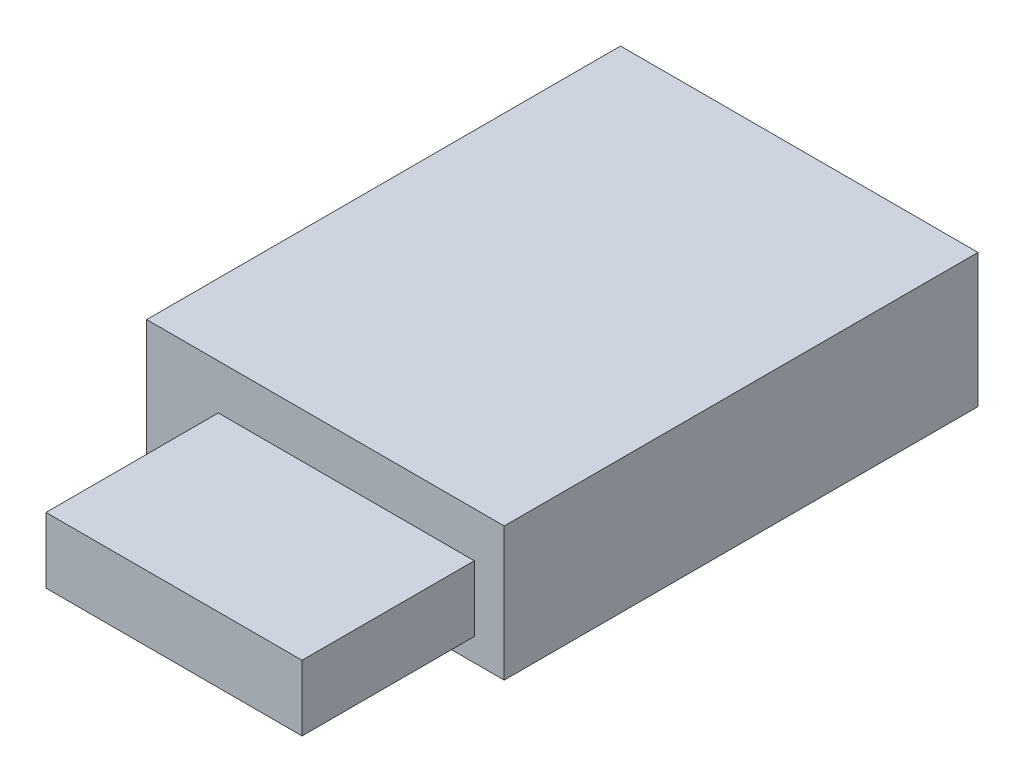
ISO-10303-21;
HEADER;
FILE_DESCRIPTION(('STEP AP214'),'2;1');
FILE_NAME('part.step','',(''),(''),'','','');
FILE_SCHEMA(('AUTOMOTIVE_DESIGN { 1 0 10303 214 1 1 1 1 }'));
ENDSEC;
DATA;
#1=APPLICATION_CONTEXT('core data for automotive mechanical design processes');
#2=APPLICATION_PROTOCOL_DEFINITION('international standard','automotive_design',2000,#1);
#3=PRODUCT_CONTEXT('',#1,'mechanical');
#4=PRODUCT('Part','Part','',(#3));
#5=PRODUCT_RELATED_PRODUCT_CATEGORY('part','',(#4));
#6=PRODUCT_DEFINITION_FORMATION('','',#4);
#7=PRODUCT_DEFINITION_CONTEXT('part definition',#1,'design');
#8=PRODUCT_DEFINITION('design','',#6,#7);
#9=PRODUCT_DEFINITION_SHAPE('','',#8);
#10=(LENGTH_UNIT() NAMED_UNIT(*) SI_UNIT(.MILLI.,.METRE.));
#11=(NAMED_UNIT(*) PLANE_ANGLE_UNIT() SI_UNIT($,.RADIAN.));
#12=(NAMED_UNIT(*) SI_UNIT($,.STERADIAN.) SOLID_ANGLE_UNIT());
#13=UNCERTAINTY_MEASURE_WITH_UNIT(LENGTH_MEASURE(1.E-05),#10,'distance_accuracy_value','');
#14=(GEOMETRIC_REPRESENTATION_CONTEXT(3) GLOBAL_UNCERTAINTY_ASSIGNED_CONTEXT((#13)) GLOBAL_UNIT_ASSIGNED_CONTEXT((#10,
#11,#12)) REPRESENTATION_CONTEXT('',''));
#15=CARTESIAN_POINT('',(0.,0.,0.));
#16=DIRECTION('',(0.,0.,1.));
#17=DIRECTION('',(1.,0.,0.));
#18=AXIS2_PLACEMENT_3D('',#15,#16,#17);
#19=CARTESIAN_POINT('',(-39.4278240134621,39.37,48.3702170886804));
#20=DIRECTION('',(0.,0.,-1.));
#21=DIRECTION('',(-1.,0.,0.));
#22=AXIS2_PLACEMENT_3D('',#19,#20,#21);
#23=PLANE('',#22);
#24=DIRECTION('',(1.,0.,0.));
#25=VECTOR('',#24,1.);
#26=CARTESIAN_POINT('',(-39.4278240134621,0.,48.3702170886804));
#27=LINE('',#26,#25);
#28=CARTESIAN_POINT('',(-39.4278240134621,0.,48.3702170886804));
#29=VERTEX_POINT('',#28);
#30=CARTESIAN_POINT('',(65.9821759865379,0.,48.3702170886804));
#31=VERTEX_POINT('',#30);
#32=EDGE_CURVE('E122',#29,#31,#27,.T.);
#33=ORIENTED_EDGE('',*,*,#32,.T.);
#34=DIRECTION('',(0.,-1.,0.));
#35=VECTOR('',#34,1.);
#36=CARTESIAN_POINT('',(65.9821759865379,39.37,48.3702170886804));
#37=LINE('',#36,#35);
#38=CARTESIAN_POINT('',(65.9821759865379,39.37,48.3702170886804));
#39=VERTEX_POINT('',#38);
#40=EDGE_CURVE('E41',#39,#31,#37,.T.);
#41=ORIENTED_EDGE('',*,*,#40,.F.);
#42=DIRECTION('',(1.,0.,0.));
#43=VECTOR('',#42,1.);
#44=CARTESIAN_POINT('',(-39.4278240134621,39.37,48.3702170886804));
#45=LINE('',#44,#43);
#46=CARTESIAN_POINT('',(-39.4278240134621,39.37,48.3702170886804));
#47=VERTEX_POINT('',#46);
#48=EDGE_CURVE('E131',#47,#39,#45,.T.);
#49=ORIENTED_EDGE('',*,*,#48,.F.);
#50=DIRECTION('',(0.,-1.,0.));
#51=VECTOR('',#50,1.);
#52=CARTESIAN_POINT('',(-39.4278240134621,39.37,48.3702170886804));
#53=LINE('',#52,#51);
#54=EDGE_CURVE('E11',#47,#29,#53,.T.);
#55=ORIENTED_EDGE('',*,*,#54,.T.);
#56=EDGE_LOOP('',(#33,#41,#49,#55));
#57=FACE_BOUND('',#56,.T.);
#58=DIRECTION('',(0.,-1.,0.));
#59=VECTOR('',#58,1.);
#60=CARTESIAN_POINT('',(-18.3243200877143,26.0740760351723,48.3702170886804));
#61=LINE('',#60,#59);
#62=CARTESIAN_POINT('',(-18.3243200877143,26.0740760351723,48.3702170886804));
#63=VERTEX_POINT('',#62);
#64=CARTESIAN_POINT('',(-18.3243200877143,6.737061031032,48.3702170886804));
#65=VERTEX_POINT('',#64);
#66=EDGE_CURVE('E118',#63,#65,#61,.T.);
#67=ORIENTED_EDGE('',*,*,#66,.F.);
#68=DIRECTION('',(-1.,0.,0.));
#69=VECTOR('',#68,1.);
#70=CARTESIAN_POINT('',(-18.3243200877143,26.0740760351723,48.3702170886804));
#71=LINE('',#70,#69);
#72=CARTESIAN_POINT('',(57.1671559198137,26.0740760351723,48.3702170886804));
#73=VERTEX_POINT('',#72);
#74=EDGE_CURVE('E115',#73,#63,#71,.T.);
#75=ORIENTED_EDGE('',*,*,#74,.F.);
#76=DIRECTION('',(0.,1.,0.));
#77=VECTOR('',#76,1.);
#78=CARTESIAN_POINT('',(57.1671559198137,26.0740760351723,48.3702170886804));
#79=LINE('',#78,#77);
#80=CARTESIAN_POINT('',(57.1671559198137,6.737061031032,48.3702170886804));
#81=VERTEX_POINT('',#80);
#82=EDGE_CURVE('E53',#81,#73,#79,.T.);
#83=ORIENTED_EDGE('',*,*,#82,.F.);
#84=DIRECTION('',(1.,0.,0.));
#85=VECTOR('',#84,1.);
#86=CARTESIAN_POINT('',(-18.3243200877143,6.737061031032,48.3702170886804));
#87=LINE('',#86,#85);
#88=EDGE_CURVE('E48',#65,#81,#87,.T.);
#89=ORIENTED_EDGE('',*,*,#88,.F.);
#90=EDGE_LOOP('',(#67,#75,#83,#89));
#91=FACE_BOUND('',#90,.T.);
#92=ADVANCED_FACE('F33',(#57,#91),#23,.F.);
#93=CARTESIAN_POINT('',(-39.4278240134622,39.37,-91.3297829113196));
#94=DIRECTION('',(1.,0.,0.));
#95=DIRECTION('',(0.,0.,-1.));
#96=AXIS2_PLACEMENT_3D('',#93,#94,#95);
#97=PLANE('',#96);
#98=DIRECTION('',(0.,0.,1.));
#99=VECTOR('',#98,1.);
#100=CARTESIAN_POINT('',(-39.4278240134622,0.,-91.3297829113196));
#101=LINE('',#100,#99);
#102=CARTESIAN_POINT('',(-39.4278240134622,0.,-91.3297829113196));
#103=VERTEX_POINT('',#102);
#104=EDGE_CURVE('E119',#103,#29,#101,.T.);
#105=ORIENTED_EDGE('',*,*,#104,.T.);
#106=ORIENTED_EDGE('',*,*,#54,.F.);
#107=DIRECTION('',(0.,0.,1.));
#108=VECTOR('',#107,1.);
#109=CARTESIAN_POINT('',(-39.4278240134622,39.37,-91.3297829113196));
#110=LINE('',#109,#108);
#111=CARTESIAN_POINT('',(-39.4278240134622,39.37,-91.3297829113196));
#112=VERTEX_POINT('',#111);
#113=EDGE_CURVE('E128',#112,#47,#110,.T.);
#114=ORIENTED_EDGE('',*,*,#113,.F.);
#115=DIRECTION('',(0.,-1.,0.));
#116=VECTOR('',#115,1.);
#117=CARTESIAN_POINT('',(-39.4278240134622,39.37,-91.3297829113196));
#118=LINE('',#117,#116);
#119=EDGE_CURVE('E137',#112,#103,#118,.T.);
#120=ORIENTED_EDGE('',*,*,#119,.T.);
#121=EDGE_LOOP('',(#105,#106,#114,#120));
#122=FACE_BOUND('',#121,.T.);
#123=ADVANCED_FACE('F35',(#122),#97,.F.);
#124=CARTESIAN_POINT('',(65.9821759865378,39.37,-91.3297829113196));
#125=DIRECTION('',(-1.,0.,0.));
#126=DIRECTION('',(0.,0.,1.));
#127=AXIS2_PLACEMENT_3D('',#124,#125,#126);
#128=PLANE('',#127);
#129=DIRECTION('',(0.,0.,-1.));
#130=VECTOR('',#129,1.);
#131=CARTESIAN_POINT('',(65.9821759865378,0.,-91.3297829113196));
#132=LINE('',#131,#130);
#133=CARTESIAN_POINT('',(65.9821759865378,0.,-91.3297829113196));
#134=VERTEX_POINT('',#133);
#135=EDGE_CURVE('E140',#31,#134,#132,.T.);
#136=ORIENTED_EDGE('',*,*,#135,.T.);
#137=DIRECTION('',(0.,-1.,0.));
#138=VECTOR('',#137,1.);
#139=CARTESIAN_POINT('',(65.9821759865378,39.37,-91.3297829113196));
#140=LINE('',#139,#138);
#141=CARTESIAN_POINT('',(65.9821759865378,39.37,-91.3297829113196));
#142=VERTEX_POINT('',#141);
#143=EDGE_CURVE('E145',#142,#134,#140,.T.);
#144=ORIENTED_EDGE('',*,*,#143,.F.);
#145=DIRECTION('',(0.,0.,-1.));
#146=VECTOR('',#145,1.);
#147=CARTESIAN_POINT('',(65.9821759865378,39.37,-91.3297829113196));
#148=LINE('',#147,#146);
#149=EDGE_CURVE('E134',#39,#142,#148,.T.);
#150=ORIENTED_EDGE('',*,*,#149,.F.);
#151=ORIENTED_EDGE('',*,*,#40,.T.);
#152=EDGE_LOOP('',(#136,#144,#150,#151));
#153=FACE_BOUND('',#152,.T.);
#154=ADVANCED_FACE('F152',(#153),#128,.F.);
#155=CARTESIAN_POINT('',(-39.4278240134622,39.37,-91.3297829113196));
#156=DIRECTION('',(0.,0.,1.));
#157=DIRECTION('',(1.,0.,0.));
#158=AXIS2_PLACEMENT_3D('',#155,#156,#157);
#159=PLANE('',#158);
#160=DIRECTION('',(-1.,0.,0.));
#161=VECTOR('',#160,1.);
#162=CARTESIAN_POINT('',(-39.4278240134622,0.,-91.3297829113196));
#163=LINE('',#162,#161);
#164=EDGE_CURVE('E132',#134,#103,#163,.T.);
#165=ORIENTED_EDGE('',*,*,#164,.T.);
#166=ORIENTED_EDGE('',*,*,#119,.F.);
#167=DIRECTION('',(-1.,0.,0.));
#168=VECTOR('',#167,1.);
#169=CARTESIAN_POINT('',(-39.4278240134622,39.37,-91.3297829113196));
#170=LINE('',#169,#168);
#171=EDGE_CURVE('E136',#142,#112,#170,.T.);
#172=ORIENTED_EDGE('',*,*,#171,.F.);
#173=ORIENTED_EDGE('',*,*,#143,.T.);
#174=EDGE_LOOP('',(#165,#166,#172,#173));
#175=FACE_BOUND('',#174,.T.);
#176=ADVANCED_FACE('F161',(#175),#159,.F.);
#177=CARTESIAN_POINT('',(-39.4278240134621,39.37,48.3702170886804));
#178=DIRECTION('',(0.,1.,0.));
#179=DIRECTION('',(0.,0.,1.));
#180=AXIS2_PLACEMENT_3D('',#177,#178,#179);
#181=PLANE('',#180);
#182=ORIENTED_EDGE('',*,*,#113,.T.);
#183=ORIENTED_EDGE('',*,*,#48,.T.);
#184=ORIENTED_EDGE('',*,*,#149,.T.);
#185=ORIENTED_EDGE('',*,*,#171,.T.);
#186=EDGE_LOOP('',(#182,#183,#184,#185));
#187=FACE_BOUND('',#186,.T.);
#188=ADVANCED_FACE('F167',(#187),#181,.T.);
#189=CARTESIAN_POINT('',(-39.4278240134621,0.,48.3702170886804));
#190=DIRECTION('',(0.,1.,0.));
#191=DIRECTION('',(0.,0.,1.));
#192=AXIS2_PLACEMENT_3D('',#189,#190,#191);
#193=PLANE('',#192);
#194=ORIENTED_EDGE('',*,*,#104,.F.);
#195=ORIENTED_EDGE('',*,*,#164,.F.);
#196=ORIENTED_EDGE('',*,*,#135,.F.);
#197=ORIENTED_EDGE('',*,*,#32,.F.);
#198=EDGE_LOOP('',(#194,#195,#196,#197));
#199=FACE_BOUND('',#198,.T.);
#200=ADVANCED_FACE('F158',(#199),#193,.F.);
#201=CARTESIAN_POINT('',(-18.3243200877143,26.0740760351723,99.1702170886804));
#202=DIRECTION('',(1.,0.,0.));
#203=DIRECTION('',(0.,0.,-1.));
#204=AXIS2_PLACEMENT_3D('',#201,#202,#203);
#205=PLANE('',#204);
#206=ORIENTED_EDGE('',*,*,#66,.T.);
#207=DIRECTION('',(0.,0.,-1.));
#208=VECTOR('',#207,1.);
#209=CARTESIAN_POINT('',(-18.3243200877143,6.737061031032,99.1702170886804));
#210=LINE('',#209,#208);
#211=CARTESIAN_POINT('',(-18.3243200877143,6.737061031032,99.1702170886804));
#212=VERTEX_POINT('',#211);
#213=EDGE_CURVE('E99',#212,#65,#210,.T.);
#214=ORIENTED_EDGE('',*,*,#213,.F.);
#215=DIRECTION('',(0.,-1.,0.));
#216=VECTOR('',#215,1.);
#217=CARTESIAN_POINT('',(-18.3243200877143,26.0740760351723,99.1702170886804));
#218=LINE('',#217,#216);
#219=CARTESIAN_POINT('',(-18.3243200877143,26.0740760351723,99.1702170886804));
#220=VERTEX_POINT('',#219);
#221=EDGE_CURVE('E106',#220,#212,#218,.T.);
#222=ORIENTED_EDGE('',*,*,#221,.F.);
#223=DIRECTION('',(0.,0.,-1.));
#224=VECTOR('',#223,1.);
#225=CARTESIAN_POINT('',(-18.3243200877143,26.0740760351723,99.1702170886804));
#226=LINE('',#225,#224);
#227=EDGE_CURVE('E174',#220,#63,#226,.T.);
#228=ORIENTED_EDGE('',*,*,#227,.T.);
#229=EDGE_LOOP('',(#206,#214,#222,#228));
#230=FACE_BOUND('',#229,.T.);
#231=ADVANCED_FACE('F117',(#230),#205,.F.);
#232=CARTESIAN_POINT('',(-18.3243200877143,6.737061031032,99.1702170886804));
#233=DIRECTION('',(0.,1.,0.));
#234=DIRECTION('',(0.,0.,1.));
#235=AXIS2_PLACEMENT_3D('',#232,#233,#234);
#236=PLANE('',#235);
#237=ORIENTED_EDGE('',*,*,#88,.T.);
#238=DIRECTION('',(0.,0.,-1.));
#239=VECTOR('',#238,1.);
#240=CARTESIAN_POINT('',(57.1671559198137,6.737061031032,99.1702170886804));
#241=LINE('',#240,#239);
#242=CARTESIAN_POINT('',(57.1671559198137,6.737061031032,99.1702170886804));
#243=VERTEX_POINT('',#242);
#244=EDGE_CURVE('E102',#243,#81,#241,.T.);
#245=ORIENTED_EDGE('',*,*,#244,.F.);
#246=DIRECTION('',(1.,0.,0.));
#247=VECTOR('',#246,1.);
#248=CARTESIAN_POINT('',(-18.3243200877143,6.737061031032,99.1702170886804));
#249=LINE('',#248,#247);
#250=EDGE_CURVE('E95',#212,#243,#249,.T.);
#251=ORIENTED_EDGE('',*,*,#250,.F.);
#252=ORIENTED_EDGE('',*,*,#213,.T.);
#253=EDGE_LOOP('',(#237,#245,#251,#252));
#254=FACE_BOUND('',#253,.T.);
#255=ADVANCED_FACE('F97',(#254),#236,.F.);
#256=CARTESIAN_POINT('',(57.1671559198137,26.0740760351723,99.1702170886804));
#257=DIRECTION('',(-1.,0.,0.));
#258=DIRECTION('',(0.,0.,1.));
#259=AXIS2_PLACEMENT_3D('',#256,#257,#258);
#260=PLANE('',#259);
#261=ORIENTED_EDGE('',*,*,#82,.T.);
#262=DIRECTION('',(0.,0.,-1.));
#263=VECTOR('',#262,1.);
#264=CARTESIAN_POINT('',(57.1671559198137,26.0740760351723,99.1702170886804));
#265=LINE('',#264,#263);
#266=CARTESIAN_POINT('',(57.1671559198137,26.0740760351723,99.1702170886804));
#267=VERTEX_POINT('',#266);
#268=EDGE_CURVE('E124',#267,#73,#265,.T.);
#269=ORIENTED_EDGE('',*,*,#268,.F.);
#270=DIRECTION('',(0.,1.,0.));
#271=VECTOR('',#270,1.);
#272=CARTESIAN_POINT('',(57.1671559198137,26.0740760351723,99.1702170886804));
#273=LINE('',#272,#271);
#274=EDGE_CURVE('E105',#243,#267,#273,.T.);
#275=ORIENTED_EDGE('',*,*,#274,.F.);
#276=ORIENTED_EDGE('',*,*,#244,.T.);
#277=EDGE_LOOP('',(#261,#269,#275,#276));
#278=FACE_BOUND('',#277,.T.);
#279=ADVANCED_FACE('F183',(#278),#260,.F.);
#280=CARTESIAN_POINT('',(-18.3243200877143,26.0740760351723,99.1702170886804));
#281=DIRECTION('',(0.,-1.,0.));
#282=DIRECTION('',(0.,0.,-1.));
#283=AXIS2_PLACEMENT_3D('',#280,#281,#282);
#284=PLANE('',#283);
#285=ORIENTED_EDGE('',*,*,#74,.T.);
#286=ORIENTED_EDGE('',*,*,#227,.F.);
#287=DIRECTION('',(-1.,0.,0.));
#288=VECTOR('',#287,1.);
#289=CARTESIAN_POINT('',(-18.3243200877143,26.0740760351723,99.1702170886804));
#290=LINE('',#289,#288);
#291=EDGE_CURVE('E111',#267,#220,#290,.T.);
#292=ORIENTED_EDGE('',*,*,#291,.F.);
#293=ORIENTED_EDGE('',*,*,#268,.T.);
#294=EDGE_LOOP('',(#285,#286,#292,#293));
#295=FACE_BOUND('',#294,.T.);
#296=ADVANCED_FACE('F173',(#295),#284,.F.);
#297=CARTESIAN_POINT('',(-18.3243200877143,6.737061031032,99.1702170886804));
#298=DIRECTION('',(0.,0.,1.));
#299=DIRECTION('',(1.,0.,0.));
#300=AXIS2_PLACEMENT_3D('',#297,#298,#299);
#301=PLANE('',#300);
#302=ORIENTED_EDGE('',*,*,#221,.T.);
#303=ORIENTED_EDGE('',*,*,#250,.T.);
#304=ORIENTED_EDGE('',*,*,#274,.T.);
#305=ORIENTED_EDGE('',*,*,#291,.T.);
#306=EDGE_LOOP('',(#302,#303,#304,#305));
#307=FACE_BOUND('',#306,.T.);
#308=ADVANCED_FACE('F109',(#307),#301,.T.);
#309=CLOSED_SHELL('',(#92,#123,#154,#176,#188,#200,#231,#255,#279,#296,#308));
#310=MANIFOLD_SOLID_BREP('B2',#309);
#311=ADVANCED_BREP_SHAPE_REPRESENTATION('',(#18,#310),#14);
#312=SHAPE_DEFINITION_REPRESENTATION(#9,#311);
ENDSEC;
END-ISO-10303-21;
